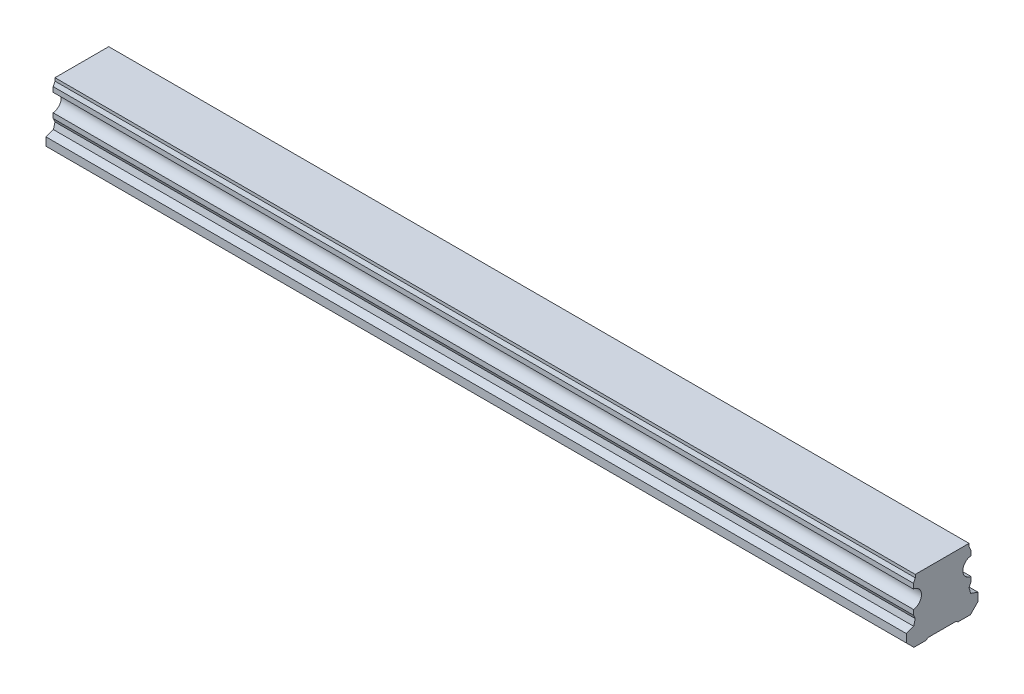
ISO-10303-21;
HEADER;
FILE_DESCRIPTION(('STEP AP214'),'2;1');
FILE_NAME('part.step','',(''),(''),'','','');
FILE_SCHEMA(('AUTOMOTIVE_DESIGN { 1 0 10303 214 1 1 1 1 }'));
ENDSEC;
DATA;
#1=APPLICATION_CONTEXT('core data for automotive mechanical design processes');
#2=APPLICATION_PROTOCOL_DEFINITION('international standard','automotive_design',2000,#1);
#3=PRODUCT_CONTEXT('',#1,'mechanical');
#4=PRODUCT('Part','Part','',(#3));
#5=PRODUCT_RELATED_PRODUCT_CATEGORY('part','',(#4));
#6=PRODUCT_DEFINITION_FORMATION('','',#4);
#7=PRODUCT_DEFINITION_CONTEXT('part definition',#1,'design');
#8=PRODUCT_DEFINITION('design','',#6,#7);
#9=PRODUCT_DEFINITION_SHAPE('','',#8);
#10=(LENGTH_UNIT() NAMED_UNIT(*) SI_UNIT(.MILLI.,.METRE.));
#11=(NAMED_UNIT(*) PLANE_ANGLE_UNIT() SI_UNIT($,.RADIAN.));
#12=(NAMED_UNIT(*) SI_UNIT($,.STERADIAN.) SOLID_ANGLE_UNIT());
#13=UNCERTAINTY_MEASURE_WITH_UNIT(LENGTH_MEASURE(1.E-05),#10,'distance_accuracy_value','');
#14=(GEOMETRIC_REPRESENTATION_CONTEXT(3) GLOBAL_UNCERTAINTY_ASSIGNED_CONTEXT((#13)) GLOBAL_UNIT_ASSIGNED_CONTEXT((#10,
#11,#12)) REPRESENTATION_CONTEXT('',''));
#15=CARTESIAN_POINT('',(0.,0.,0.));
#16=DIRECTION('',(0.,0.,1.));
#17=DIRECTION('',(1.,0.,0.));
#18=AXIS2_PLACEMENT_3D('',#15,#16,#17);
#19=CARTESIAN_POINT('',(270.,0.499999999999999,0.));
#20=DIRECTION('',(0.,-1.,0.));
#21=DIRECTION('',(0.,0.,-1.));
#22=AXIS2_PLACEMENT_3D('',#19,#20,#21);
#23=CONICAL_SURFACE('',#22,3.5,0.785398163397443);
#24=CARTESIAN_POINT('',(270.,1.00000000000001,0.));
#25=DIRECTION('',(0.,1.,0.));
#26=DIRECTION('',(0.,0.,1.));
#27=AXIS2_PLACEMENT_3D('',#24,#25,#26);
#28=CIRCLE('',#27,3.);
#29=CARTESIAN_POINT('',(270.,1.00000000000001,3.));
#30=VERTEX_POINT('',#29);
#31=EDGE_CURVE('E11',#30,#30,#28,.F.);
#32=ORIENTED_EDGE('',*,*,#31,.F.);
#33=EDGE_LOOP('',(#32));
#34=FACE_BOUND('',#33,.T.);
#35=CARTESIAN_POINT('',(270.,0.499999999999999,0.));
#36=DIRECTION('',(0.,1.,0.));
#37=DIRECTION('',(0.,0.,1.));
#38=AXIS2_PLACEMENT_3D('',#35,#36,#37);
#39=CIRCLE('',#38,3.5);
#40=CARTESIAN_POINT('',(270.,0.5,3.5));
#41=VERTEX_POINT('',#40);
#42=EDGE_CURVE('E457',#41,#41,#39,.T.);
#43=ORIENTED_EDGE('',*,*,#42,.F.);
#44=EDGE_LOOP('',(#43));
#45=FACE_BOUND('',#44,.T.);
#46=ADVANCED_FACE('F39',(#34,#45),#23,.F.);
#47=CARTESIAN_POINT('',(270.,12.,0.));
#48=DIRECTION('',(0.,-1.,0.));
#49=DIRECTION('',(0.,0.,-1.));
#50=AXIS2_PLACEMENT_3D('',#47,#48,#49);
#51=CYLINDRICAL_SURFACE('',#50,3.);
#52=ORIENTED_EDGE('',*,*,#31,.T.);
#53=EDGE_LOOP('',(#52));
#54=FACE_BOUND('',#53,.T.);
#55=CARTESIAN_POINT('',(270.,12.,0.));
#56=DIRECTION('',(0.,-1.,0.));
#57=DIRECTION('',(0.,0.,-1.));
#58=AXIS2_PLACEMENT_3D('',#55,#56,#57);
#59=CIRCLE('',#58,3.);
#60=CARTESIAN_POINT('',(270.,12.,-3.));
#61=VERTEX_POINT('',#60);
#62=EDGE_CURVE('E49',#61,#61,#59,.T.);
#63=ORIENTED_EDGE('',*,*,#62,.F.);
#64=EDGE_LOOP('',(#63));
#65=FACE_BOUND('',#64,.T.);
#66=ADVANCED_FACE('F612',(#54,#65),#51,.F.);
#67=CARTESIAN_POINT('',(270.,12.,0.));
#68=DIRECTION('',(0.,-1.,0.));
#69=DIRECTION('',(0.,0.,-1.));
#70=AXIS2_PLACEMENT_3D('',#67,#68,#69);
#71=PLANE('',#70);
#72=CARTESIAN_POINT('',(270.,12.,0.));
#73=DIRECTION('',(0.,-1.,0.));
#74=DIRECTION('',(0.,0.,-1.));
#75=AXIS2_PLACEMENT_3D('',#72,#73,#74);
#76=CIRCLE('',#75,2.5);
#77=CARTESIAN_POINT('',(270.,12.,-2.5));
#78=VERTEX_POINT('',#77);
#79=EDGE_CURVE('E42',#78,#78,#76,.T.);
#80=ORIENTED_EDGE('',*,*,#79,.F.);
#81=EDGE_LOOP('',(#80));
#82=FACE_BOUND('',#81,.T.);
#83=ORIENTED_EDGE('',*,*,#62,.T.);
#84=EDGE_LOOP('',(#83));
#85=FACE_BOUND('',#84,.T.);
#86=ADVANCED_FACE('F617',(#82,#85),#71,.T.);
#87=CARTESIAN_POINT('',(210.,0.499999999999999,0.));
#88=DIRECTION('',(0.,-1.,0.));
#89=DIRECTION('',(0.,0.,-1.));
#90=AXIS2_PLACEMENT_3D('',#87,#88,#89);
#91=CONICAL_SURFACE('',#90,3.5,0.785398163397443);
#92=CARTESIAN_POINT('',(210.,1.00000000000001,0.));
#93=DIRECTION('',(0.,1.,0.));
#94=DIRECTION('',(0.,0.,1.));
#95=AXIS2_PLACEMENT_3D('',#92,#93,#94);
#96=CIRCLE('',#95,3.);
#97=CARTESIAN_POINT('',(210.,1.00000000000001,3.));
#98=VERTEX_POINT('',#97);
#99=EDGE_CURVE('E453',#98,#98,#96,.F.);
#100=ORIENTED_EDGE('',*,*,#99,.F.);
#101=EDGE_LOOP('',(#100));
#102=FACE_BOUND('',#101,.T.);
#103=CARTESIAN_POINT('',(210.,0.499999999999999,0.));
#104=DIRECTION('',(0.,1.,0.));
#105=DIRECTION('',(0.,0.,1.));
#106=AXIS2_PLACEMENT_3D('',#103,#104,#105);
#107=CIRCLE('',#106,3.5);
#108=CARTESIAN_POINT('',(210.,0.5,3.5));
#109=VERTEX_POINT('',#108);
#110=EDGE_CURVE('E445',#109,#109,#107,.T.);
#111=ORIENTED_EDGE('',*,*,#110,.F.);
#112=EDGE_LOOP('',(#111));
#113=FACE_BOUND('',#112,.T.);
#114=ADVANCED_FACE('F716',(#102,#113),#91,.F.);
#115=CARTESIAN_POINT('',(210.,12.,0.));
#116=DIRECTION('',(0.,-1.,0.));
#117=DIRECTION('',(0.,0.,-1.));
#118=AXIS2_PLACEMENT_3D('',#115,#116,#117);
#119=CYLINDRICAL_SURFACE('',#118,3.);
#120=ORIENTED_EDGE('',*,*,#99,.T.);
#121=EDGE_LOOP('',(#120));
#122=FACE_BOUND('',#121,.T.);
#123=CARTESIAN_POINT('',(210.,12.,0.));
#124=DIRECTION('',(0.,-1.,0.));
#125=DIRECTION('',(0.,0.,-1.));
#126=AXIS2_PLACEMENT_3D('',#123,#124,#125);
#127=CIRCLE('',#126,3.);
#128=CARTESIAN_POINT('',(210.,12.,-3.));
#129=VERTEX_POINT('',#128);
#130=EDGE_CURVE('E449',#129,#129,#127,.T.);
#131=ORIENTED_EDGE('',*,*,#130,.F.);
#132=EDGE_LOOP('',(#131));
#133=FACE_BOUND('',#132,.T.);
#134=ADVANCED_FACE('F712',(#122,#133),#119,.F.);
#135=CARTESIAN_POINT('',(210.,12.,0.));
#136=DIRECTION('',(0.,-1.,0.));
#137=DIRECTION('',(0.,0.,-1.));
#138=AXIS2_PLACEMENT_3D('',#135,#136,#137);
#139=PLANE('',#138);
#140=CARTESIAN_POINT('',(210.,12.,0.));
#141=DIRECTION('',(0.,-1.,0.));
#142=DIRECTION('',(0.,0.,-1.));
#143=AXIS2_PLACEMENT_3D('',#140,#141,#142);
#144=CIRCLE('',#143,2.5);
#145=CARTESIAN_POINT('',(210.,12.,-2.5));
#146=VERTEX_POINT('',#145);
#147=EDGE_CURVE('E472',#146,#146,#144,.T.);
#148=ORIENTED_EDGE('',*,*,#147,.F.);
#149=EDGE_LOOP('',(#148));
#150=FACE_BOUND('',#149,.T.);
#151=ORIENTED_EDGE('',*,*,#130,.T.);
#152=EDGE_LOOP('',(#151));
#153=FACE_BOUND('',#152,.T.);
#154=ADVANCED_FACE('F708',(#150,#153),#139,.T.);
#155=CARTESIAN_POINT('',(150.,0.499999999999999,0.));
#156=DIRECTION('',(0.,-1.,0.));
#157=DIRECTION('',(0.,0.,-1.));
#158=AXIS2_PLACEMENT_3D('',#155,#156,#157);
#159=CONICAL_SURFACE('',#158,3.5,0.785398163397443);
#160=CARTESIAN_POINT('',(150.,1.00000000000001,0.));
#161=DIRECTION('',(0.,1.,0.));
#162=DIRECTION('',(0.,0.,1.));
#163=AXIS2_PLACEMENT_3D('',#160,#161,#162);
#164=CIRCLE('',#163,3.);
#165=CARTESIAN_POINT('',(150.,1.00000000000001,3.));
#166=VERTEX_POINT('',#165);
#167=EDGE_CURVE('E441',#166,#166,#164,.F.);
#168=ORIENTED_EDGE('',*,*,#167,.F.);
#169=EDGE_LOOP('',(#168));
#170=FACE_BOUND('',#169,.T.);
#171=CARTESIAN_POINT('',(150.,0.499999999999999,0.));
#172=DIRECTION('',(0.,1.,0.));
#173=DIRECTION('',(0.,0.,1.));
#174=AXIS2_PLACEMENT_3D('',#171,#172,#173);
#175=CIRCLE('',#174,3.5);
#176=CARTESIAN_POINT('',(150.,0.5,3.5));
#177=VERTEX_POINT('',#176);
#178=EDGE_CURVE('E433',#177,#177,#175,.T.);
#179=ORIENTED_EDGE('',*,*,#178,.F.);
#180=EDGE_LOOP('',(#179));
#181=FACE_BOUND('',#180,.T.);
#182=ADVANCED_FACE('F704',(#170,#181),#159,.F.);
#183=CARTESIAN_POINT('',(150.,12.,0.));
#184=DIRECTION('',(0.,-1.,0.));
#185=DIRECTION('',(0.,0.,-1.));
#186=AXIS2_PLACEMENT_3D('',#183,#184,#185);
#187=CYLINDRICAL_SURFACE('',#186,3.);
#188=ORIENTED_EDGE('',*,*,#167,.T.);
#189=EDGE_LOOP('',(#188));
#190=FACE_BOUND('',#189,.T.);
#191=CARTESIAN_POINT('',(150.,12.,0.));
#192=DIRECTION('',(0.,-1.,0.));
#193=DIRECTION('',(0.,0.,-1.));
#194=AXIS2_PLACEMENT_3D('',#191,#192,#193);
#195=CIRCLE('',#194,3.);
#196=CARTESIAN_POINT('',(150.,12.,-3.));
#197=VERTEX_POINT('',#196);
#198=EDGE_CURVE('E437',#197,#197,#195,.T.);
#199=ORIENTED_EDGE('',*,*,#198,.F.);
#200=EDGE_LOOP('',(#199));
#201=FACE_BOUND('',#200,.T.);
#202=ADVANCED_FACE('F700',(#190,#201),#187,.F.);
#203=CARTESIAN_POINT('',(150.,12.,0.));
#204=DIRECTION('',(0.,-1.,0.));
#205=DIRECTION('',(0.,0.,-1.));
#206=AXIS2_PLACEMENT_3D('',#203,#204,#205);
#207=PLANE('',#206);
#208=CARTESIAN_POINT('',(150.,12.,0.));
#209=DIRECTION('',(0.,-1.,0.));
#210=DIRECTION('',(0.,0.,-1.));
#211=AXIS2_PLACEMENT_3D('',#208,#209,#210);
#212=CIRCLE('',#211,2.5);
#213=CARTESIAN_POINT('',(150.,12.,-2.5));
#214=VERTEX_POINT('',#213);
#215=EDGE_CURVE('E468',#214,#214,#212,.T.);
#216=ORIENTED_EDGE('',*,*,#215,.F.);
#217=EDGE_LOOP('',(#216));
#218=FACE_BOUND('',#217,.T.);
#219=ORIENTED_EDGE('',*,*,#198,.T.);
#220=EDGE_LOOP('',(#219));
#221=FACE_BOUND('',#220,.T.);
#222=ADVANCED_FACE('F690',(#218,#221),#207,.T.);
#223=CARTESIAN_POINT('',(300.,21.8,-9.375));
#224=DIRECTION('',(0.,0.,1.));
#225=DIRECTION('',(0.,-1.,0.));
#226=AXIS2_PLACEMENT_3D('',#223,#224,#225);
#227=PLANE('',#226);
#228=DIRECTION('',(0.,1.,0.));
#229=VECTOR('',#228,1.);
#230=CARTESIAN_POINT('',(0.,21.8,-9.375));
#231=LINE('',#230,#229);
#232=CARTESIAN_POINT('',(0.,20.756,-9.375));
#233=VERTEX_POINT('',#232);
#234=CARTESIAN_POINT('',(0.,21.8,-9.375));
#235=VERTEX_POINT('',#234);
#236=EDGE_CURVE('E256',#233,#235,#231,.T.);
#237=ORIENTED_EDGE('',*,*,#236,.T.);
#238=DIRECTION('',(-1.,0.,0.));
#239=VECTOR('',#238,1.);
#240=CARTESIAN_POINT('',(300.,21.8,-9.375));
#241=LINE('',#240,#239);
#242=CARTESIAN_POINT('',(300.,21.8,-9.375));
#243=VERTEX_POINT('',#242);
#244=EDGE_CURVE('E422',#243,#235,#241,.T.);
#245=ORIENTED_EDGE('',*,*,#244,.F.);
#246=DIRECTION('',(0.,1.,0.));
#247=VECTOR('',#246,1.);
#248=CARTESIAN_POINT('',(300.,21.8,-9.375));
#249=LINE('',#248,#247);
#250=CARTESIAN_POINT('',(300.,20.756,-9.375));
#251=VERTEX_POINT('',#250);
#252=EDGE_CURVE('E331',#251,#243,#249,.T.);
#253=ORIENTED_EDGE('',*,*,#252,.F.);
#254=DIRECTION('',(-1.,0.,0.));
#255=VECTOR('',#254,1.);
#256=CARTESIAN_POINT('',(300.,20.756,-9.375));
#257=LINE('',#256,#255);
#258=EDGE_CURVE('E252',#251,#233,#257,.T.);
#259=ORIENTED_EDGE('',*,*,#258,.T.);
#260=EDGE_LOOP('',(#237,#245,#253,#259));
#261=FACE_BOUND('',#260,.T.);
#262=ADVANCED_FACE('F687',(#261),#227,.F.);
#263=CARTESIAN_POINT('',(300.,21.8,-9.375));
#264=DIRECTION('',(0.,-1.,0.));
#265=DIRECTION('',(0.,0.,-1.));
#266=AXIS2_PLACEMENT_3D('',#263,#264,#265);
#267=PLANE('',#266);
#268=DIRECTION('',(0.,0.,1.));
#269=VECTOR('',#268,1.);
#270=CARTESIAN_POINT('',(0.,21.8,-9.375));
#271=LINE('',#270,#269);
#272=CARTESIAN_POINT('',(0.,21.8,9.375));
#273=VERTEX_POINT('',#272);
#274=EDGE_CURVE('E260',#235,#273,#271,.T.);
#275=ORIENTED_EDGE('',*,*,#274,.T.);
#276=DIRECTION('',(-1.,0.,0.));
#277=VECTOR('',#276,1.);
#278=CARTESIAN_POINT('',(300.,21.8,9.375));
#279=LINE('',#278,#277);
#280=CARTESIAN_POINT('',(300.,21.8,9.375));
#281=VERTEX_POINT('',#280);
#282=EDGE_CURVE('E418',#281,#273,#279,.T.);
#283=ORIENTED_EDGE('',*,*,#282,.F.);
#284=DIRECTION('',(0.,0.,1.));
#285=VECTOR('',#284,1.);
#286=CARTESIAN_POINT('',(300.,21.8,-9.375));
#287=LINE('',#286,#285);
#288=EDGE_CURVE('E157',#243,#281,#287,.T.);
#289=ORIENTED_EDGE('',*,*,#288,.F.);
#290=ORIENTED_EDGE('',*,*,#244,.T.);
#291=EDGE_LOOP('',(#275,#283,#289,#290));
#292=FACE_BOUND('',#291,.T.);
#293=ADVANCED_FACE('F683',(#292),#267,.F.);
#294=CARTESIAN_POINT('',(300.,21.8,9.375));
#295=DIRECTION('',(0.,0.,-1.));
#296=DIRECTION('',(0.,1.,0.));
#297=AXIS2_PLACEMENT_3D('',#294,#295,#296);
#298=PLANE('',#297);
#299=DIRECTION('',(0.,-1.,0.));
#300=VECTOR('',#299,1.);
#301=CARTESIAN_POINT('',(0.,21.8,9.375));
#302=LINE('',#301,#300);
#303=CARTESIAN_POINT('',(0.,20.756,9.37499999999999));
#304=VERTEX_POINT('',#303);
#305=EDGE_CURVE('E264',#273,#304,#302,.T.);
#306=ORIENTED_EDGE('',*,*,#305,.T.);
#307=DIRECTION('',(-1.,0.,0.));
#308=VECTOR('',#307,1.);
#309=CARTESIAN_POINT('',(300.,20.756,9.37499999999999));
#310=LINE('',#309,#308);
#311=CARTESIAN_POINT('',(300.,20.756,9.37499999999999));
#312=VERTEX_POINT('',#311);
#313=EDGE_CURVE('E414',#312,#304,#310,.T.);
#314=ORIENTED_EDGE('',*,*,#313,.F.);
#315=DIRECTION('',(0.,-1.,0.));
#316=VECTOR('',#315,1.);
#317=CARTESIAN_POINT('',(300.,21.8,9.375));
#318=LINE('',#317,#316);
#319=EDGE_CURVE('E515',#281,#312,#318,.T.);
#320=ORIENTED_EDGE('',*,*,#319,.F.);
#321=ORIENTED_EDGE('',*,*,#282,.T.);
#322=EDGE_LOOP('',(#306,#314,#320,#321));
#323=FACE_BOUND('',#322,.T.);
#324=ADVANCED_FACE('F679',(#323),#298,.F.);
#325=CARTESIAN_POINT('',(300.,20.756,9.37499999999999));
#326=DIRECTION('',(0.,-0.422618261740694,-0.906307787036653));
#327=DIRECTION('',(0.,0.906307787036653,-0.422618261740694));
#328=AXIS2_PLACEMENT_3D('',#325,#326,#327);
#329=PLANE('',#328);
#330=DIRECTION('',(0.,-0.906307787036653,0.422618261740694));
#331=VECTOR('',#330,1.);
#332=CARTESIAN_POINT('',(0.,20.756,9.37499999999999));
#333=LINE('',#332,#331);
#334=CARTESIAN_POINT('',(0.,19.4156831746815,10.));
#335=VERTEX_POINT('',#334);
#336=EDGE_CURVE('E267',#304,#335,#333,.T.);
#337=ORIENTED_EDGE('',*,*,#336,.T.);
#338=DIRECTION('',(-1.,0.,0.));
#339=VECTOR('',#338,1.);
#340=CARTESIAN_POINT('',(300.,19.4156831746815,10.));
#341=LINE('',#340,#339);
#342=CARTESIAN_POINT('',(300.,19.4156831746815,10.));
#343=VERTEX_POINT('',#342);
#344=EDGE_CURVE('E410',#343,#335,#341,.T.);
#345=ORIENTED_EDGE('',*,*,#344,.F.);
#346=DIRECTION('',(0.,-0.906307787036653,0.422618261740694));
#347=VECTOR('',#346,1.);
#348=CARTESIAN_POINT('',(300.,20.756,9.37499999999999));
#349=LINE('',#348,#347);
#350=EDGE_CURVE('E518',#312,#343,#349,.T.);
#351=ORIENTED_EDGE('',*,*,#350,.F.);
#352=ORIENTED_EDGE('',*,*,#313,.T.);
#353=EDGE_LOOP('',(#337,#345,#351,#352));
#354=FACE_BOUND('',#353,.T.);
#355=ADVANCED_FACE('F675',(#354),#329,.F.);
#356=CARTESIAN_POINT('',(300.,19.4156831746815,10.));
#357=DIRECTION('',(0.,0.,-1.));
#358=DIRECTION('',(-1.,0.,0.));
#359=AXIS2_PLACEMENT_3D('',#356,#357,#358);
#360=PLANE('',#359);
#361=DIRECTION('',(0.,-1.,0.));
#362=VECTOR('',#361,1.);
#363=CARTESIAN_POINT('',(0.,19.4156831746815,10.));
#364=LINE('',#363,#362);
#365=CARTESIAN_POINT('',(0.,17.6854497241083,10.));
#366=VERTEX_POINT('',#365);
#367=EDGE_CURVE('E269',#335,#366,#364,.T.);
#368=ORIENTED_EDGE('',*,*,#367,.T.);
#369=DIRECTION('',(-1.,0.,0.));
#370=VECTOR('',#369,1.);
#371=CARTESIAN_POINT('',(300.,17.6854497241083,10.));
#372=LINE('',#371,#370);
#373=CARTESIAN_POINT('',(300.,17.6854497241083,10.));
#374=VERTEX_POINT('',#373);
#375=EDGE_CURVE('E406',#374,#366,#372,.T.);
#376=ORIENTED_EDGE('',*,*,#375,.F.);
#377=DIRECTION('',(0.,-1.,0.));
#378=VECTOR('',#377,1.);
#379=CARTESIAN_POINT('',(300.,19.4156831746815,10.));
#380=LINE('',#379,#378);
#381=EDGE_CURVE('E521',#343,#374,#380,.T.);
#382=ORIENTED_EDGE('',*,*,#381,.F.);
#383=ORIENTED_EDGE('',*,*,#344,.T.);
#384=EDGE_LOOP('',(#368,#376,#382,#383));
#385=FACE_BOUND('',#384,.T.);
#386=ADVANCED_FACE('F671',(#385),#360,.F.);
#387=CARTESIAN_POINT('',(300.,14.6,10.3));
#388=DIRECTION('',(-1.,0.,0.));
#389=DIRECTION('',(0.,0.,1.));
#390=AXIS2_PLACEMENT_3D('',#387,#388,#389);
#391=CYLINDRICAL_SURFACE('',#390,3.1);
#392=CARTESIAN_POINT('',(0.,14.6,10.3));
#393=DIRECTION('',(-1.,0.,0.));
#394=DIRECTION('',(0.,0.,-1.));
#395=AXIS2_PLACEMENT_3D('',#392,#393,#394);
#396=CIRCLE('',#395,3.1);
#397=CARTESIAN_POINT('',(0.,11.5145502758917,10.));
#398=VERTEX_POINT('',#397);
#399=EDGE_CURVE('E272',#366,#398,#396,.T.);
#400=ORIENTED_EDGE('',*,*,#399,.T.);
#401=DIRECTION('',(-1.,0.,0.));
#402=VECTOR('',#401,1.);
#403=CARTESIAN_POINT('',(300.,11.5145502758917,10.));
#404=LINE('',#403,#402);
#405=CARTESIAN_POINT('',(300.,11.5145502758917,10.));
#406=VERTEX_POINT('',#405);
#407=EDGE_CURVE('E402',#406,#398,#404,.T.);
#408=ORIENTED_EDGE('',*,*,#407,.F.);
#409=CARTESIAN_POINT('',(300.,14.6,10.3));
#410=DIRECTION('',(-1.,0.,0.));
#411=DIRECTION('',(0.,0.,-1.));
#412=AXIS2_PLACEMENT_3D('',#409,#410,#411);
#413=CIRCLE('',#412,3.1);
#414=EDGE_CURVE('E524',#374,#406,#413,.T.);
#415=ORIENTED_EDGE('',*,*,#414,.F.);
#416=ORIENTED_EDGE('',*,*,#375,.T.);
#417=EDGE_LOOP('',(#400,#408,#415,#416));
#418=FACE_BOUND('',#417,.T.);
#419=ADVANCED_FACE('F667',(#418),#391,.F.);
#420=CARTESIAN_POINT('',(300.,9.78431682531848,10.));
#421=DIRECTION('',(0.,0.,-1.));
#422=DIRECTION('',(0.,1.,0.));
#423=AXIS2_PLACEMENT_3D('',#420,#421,#422);
#424=PLANE('',#423);
#425=DIRECTION('',(0.,-1.,0.));
#426=VECTOR('',#425,1.);
#427=CARTESIAN_POINT('',(0.,9.78431682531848,10.));
#428=LINE('',#427,#426);
#429=CARTESIAN_POINT('',(0.,9.78431682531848,10.));
#430=VERTEX_POINT('',#429);
#431=EDGE_CURVE('E275',#398,#430,#428,.T.);
#432=ORIENTED_EDGE('',*,*,#431,.T.);
#433=DIRECTION('',(-1.,0.,0.));
#434=VECTOR('',#433,1.);
#435=CARTESIAN_POINT('',(300.,9.78431682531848,10.));
#436=LINE('',#435,#434);
#437=CARTESIAN_POINT('',(300.,9.78431682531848,10.));
#438=VERTEX_POINT('',#437);
#439=EDGE_CURVE('E398',#438,#430,#436,.T.);
#440=ORIENTED_EDGE('',*,*,#439,.F.);
#441=DIRECTION('',(0.,-1.,0.));
#442=VECTOR('',#441,1.);
#443=CARTESIAN_POINT('',(300.,9.78431682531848,10.));
#444=LINE('',#443,#442);
#445=EDGE_CURVE('E526',#406,#438,#444,.T.);
#446=ORIENTED_EDGE('',*,*,#445,.F.);
#447=ORIENTED_EDGE('',*,*,#407,.T.);
#448=EDGE_LOOP('',(#432,#440,#446,#447));
#449=FACE_BOUND('',#448,.T.);
#450=ADVANCED_FACE('F663',(#449),#424,.F.);
#451=CARTESIAN_POINT('',(300.,8.44400000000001,9.375));
#452=DIRECTION('',(0.,0.4226182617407,-0.90630778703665));
#453=DIRECTION('',(0.,0.90630778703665,0.4226182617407));
#454=AXIS2_PLACEMENT_3D('',#451,#452,#453);
#455=PLANE('',#454);
#456=DIRECTION('',(0.,-0.90630778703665,-0.4226182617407));
#457=VECTOR('',#456,1.);
#458=CARTESIAN_POINT('',(0.,8.44400000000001,9.375));
#459=LINE('',#458,#457);
#460=CARTESIAN_POINT('',(0.,8.44400000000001,9.375));
#461=VERTEX_POINT('',#460);
#462=EDGE_CURVE('E278',#430,#461,#459,.T.);
#463=ORIENTED_EDGE('',*,*,#462,.T.);
#464=DIRECTION('',(-1.,0.,0.));
#465=VECTOR('',#464,1.);
#466=CARTESIAN_POINT('',(300.,8.44400000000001,9.375));
#467=LINE('',#466,#465);
#468=CARTESIAN_POINT('',(300.,8.44400000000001,9.375));
#469=VERTEX_POINT('',#468);
#470=EDGE_CURVE('E394',#469,#461,#467,.T.);
#471=ORIENTED_EDGE('',*,*,#470,.F.);
#472=DIRECTION('',(0.,-0.90630778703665,-0.4226182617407));
#473=VECTOR('',#472,1.);
#474=CARTESIAN_POINT('',(300.,8.44400000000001,9.375));
#475=LINE('',#474,#473);
#476=EDGE_CURVE('E529',#438,#469,#475,.T.);
#477=ORIENTED_EDGE('',*,*,#476,.F.);
#478=ORIENTED_EDGE('',*,*,#439,.T.);
#479=EDGE_LOOP('',(#463,#471,#477,#478));
#480=FACE_BOUND('',#479,.T.);
#481=ADVANCED_FACE('F659',(#480),#455,.F.);
#482=CARTESIAN_POINT('',(300.,6.4,9.92268814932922));
#483=DIRECTION('',(0.,-0.258819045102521,-0.965925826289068));
#484=DIRECTION('',(0.,0.965925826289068,-0.258819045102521));
#485=AXIS2_PLACEMENT_3D('',#482,#483,#484);
#486=PLANE('',#485);
#487=DIRECTION('',(0.,-0.965925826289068,0.258819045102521));
#488=VECTOR('',#487,1.);
#489=CARTESIAN_POINT('',(0.,6.4,9.92268814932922));
#490=LINE('',#489,#488);
#491=CARTESIAN_POINT('',(0.,6.4,9.92268814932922));
#492=VERTEX_POINT('',#491);
#493=EDGE_CURVE('E281',#461,#492,#490,.T.);
#494=ORIENTED_EDGE('',*,*,#493,.T.);
#495=DIRECTION('',(-1.,0.,0.));
#496=VECTOR('',#495,1.);
#497=CARTESIAN_POINT('',(300.,6.4,9.92268814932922));
#498=LINE('',#497,#496);
#499=CARTESIAN_POINT('',(300.,6.4,9.92268814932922));
#500=VERTEX_POINT('',#499);
#501=EDGE_CURVE('E390',#500,#492,#498,.T.);
#502=ORIENTED_EDGE('',*,*,#501,.F.);
#503=DIRECTION('',(0.,-0.965925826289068,0.258819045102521));
#504=VECTOR('',#503,1.);
#505=CARTESIAN_POINT('',(300.,6.4,9.92268814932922));
#506=LINE('',#505,#504);
#507=EDGE_CURVE('E532',#469,#500,#506,.T.);
#508=ORIENTED_EDGE('',*,*,#507,.F.);
#509=ORIENTED_EDGE('',*,*,#470,.T.);
#510=EDGE_LOOP('',(#494,#502,#508,#509));
#511=FACE_BOUND('',#510,.T.);
#512=ADVANCED_FACE('F655',(#511),#486,.F.);
#513=CARTESIAN_POINT('',(300.,5.48933857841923,12.5));
#514=DIRECTION('',(0.,-0.942872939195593,-0.333152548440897));
#515=DIRECTION('',(0.,0.333152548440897,-0.942872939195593));
#516=AXIS2_PLACEMENT_3D('',#513,#514,#515);
#517=PLANE('',#516);
#518=DIRECTION('',(0.,-0.333152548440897,0.942872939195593));
#519=VECTOR('',#518,1.);
#520=CARTESIAN_POINT('',(0.,5.48933857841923,12.5));
#521=LINE('',#520,#519);
#522=CARTESIAN_POINT('',(0.,5.48933857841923,12.5));
#523=VERTEX_POINT('',#522);
#524=EDGE_CURVE('E284',#492,#523,#521,.T.);
#525=ORIENTED_EDGE('',*,*,#524,.T.);
#526=DIRECTION('',(-1.,0.,0.));
#527=VECTOR('',#526,1.);
#528=CARTESIAN_POINT('',(300.,5.48933857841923,12.5));
#529=LINE('',#528,#527);
#530=CARTESIAN_POINT('',(300.,5.48933857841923,12.5));
#531=VERTEX_POINT('',#530);
#532=EDGE_CURVE('E386',#531,#523,#529,.T.);
#533=ORIENTED_EDGE('',*,*,#532,.F.);
#534=DIRECTION('',(0.,-0.333152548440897,0.942872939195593));
#535=VECTOR('',#534,1.);
#536=CARTESIAN_POINT('',(300.,5.48933857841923,12.5));
#537=LINE('',#536,#535);
#538=EDGE_CURVE('E535',#500,#531,#537,.T.);
#539=ORIENTED_EDGE('',*,*,#538,.F.);
#540=ORIENTED_EDGE('',*,*,#501,.T.);
#541=EDGE_LOOP('',(#525,#533,#539,#540));
#542=FACE_BOUND('',#541,.T.);
#543=ADVANCED_FACE('F651',(#542),#517,.F.);
#544=CARTESIAN_POINT('',(300.,2.65,12.5));
#545=DIRECTION('',(0.,0.,-1.));
#546=DIRECTION('',(0.,1.,0.));
#547=AXIS2_PLACEMENT_3D('',#544,#545,#546);
#548=PLANE('',#547);
#549=DIRECTION('',(0.,-1.,0.));
#550=VECTOR('',#549,1.);
#551=CARTESIAN_POINT('',(0.,2.65,12.5));
#552=LINE('',#551,#550);
#553=CARTESIAN_POINT('',(0.,2.65,12.5));
#554=VERTEX_POINT('',#553);
#555=EDGE_CURVE('E287',#523,#554,#552,.T.);
#556=ORIENTED_EDGE('',*,*,#555,.T.);
#557=DIRECTION('',(-1.,0.,0.));
#558=VECTOR('',#557,1.);
#559=CARTESIAN_POINT('',(300.,2.65,12.5));
#560=LINE('',#559,#558);
#561=CARTESIAN_POINT('',(300.,2.65,12.5));
#562=VERTEX_POINT('',#561);
#563=EDGE_CURVE('E382',#562,#554,#560,.T.);
#564=ORIENTED_EDGE('',*,*,#563,.F.);
#565=DIRECTION('',(0.,-1.,0.));
#566=VECTOR('',#565,1.);
#567=CARTESIAN_POINT('',(300.,2.65,12.5));
#568=LINE('',#567,#566);
#569=EDGE_CURVE('E538',#531,#562,#568,.T.);
#570=ORIENTED_EDGE('',*,*,#569,.F.);
#571=ORIENTED_EDGE('',*,*,#532,.T.);
#572=EDGE_LOOP('',(#556,#564,#570,#571));
#573=FACE_BOUND('',#572,.T.);
#574=ADVANCED_FACE('F647',(#573),#548,.F.);
#575=CARTESIAN_POINT('',(300.,0.,9.85));
#576=DIRECTION('',(0.,0.707106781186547,-0.707106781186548));
#577=DIRECTION('',(0.,0.707106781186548,0.707106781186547));
#578=AXIS2_PLACEMENT_3D('',#575,#576,#577);
#579=PLANE('',#578);
#580=DIRECTION('',(0.,-0.707106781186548,-0.707106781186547));
#581=VECTOR('',#580,1.);
#582=CARTESIAN_POINT('',(0.,0.,9.85));
#583=LINE('',#582,#581);
#584=CARTESIAN_POINT('',(0.,0.,9.85));
#585=VERTEX_POINT('',#584);
#586=EDGE_CURVE('E290',#554,#585,#583,.T.);
#587=ORIENTED_EDGE('',*,*,#586,.T.);
#588=DIRECTION('',(-1.,0.,0.));
#589=VECTOR('',#588,1.);
#590=CARTESIAN_POINT('',(300.,0.,9.85));
#591=LINE('',#590,#589);
#592=CARTESIAN_POINT('',(300.,0.,9.85));
#593=VERTEX_POINT('',#592);
#594=EDGE_CURVE('E378',#593,#585,#591,.T.);
#595=ORIENTED_EDGE('',*,*,#594,.F.);
#596=DIRECTION('',(0.,-0.707106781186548,-0.707106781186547));
#597=VECTOR('',#596,1.);
#598=CARTESIAN_POINT('',(300.,0.,9.85));
#599=LINE('',#598,#597);
#600=EDGE_CURVE('E541',#562,#593,#599,.T.);
#601=ORIENTED_EDGE('',*,*,#600,.F.);
#602=ORIENTED_EDGE('',*,*,#563,.T.);
#603=EDGE_LOOP('',(#587,#595,#601,#602));
#604=FACE_BOUND('',#603,.T.);
#605=ADVANCED_FACE('F643',(#604),#579,.F.);
#606=CARTESIAN_POINT('',(300.,0.,5.5));
#607=DIRECTION('',(0.,1.,0.));
#608=DIRECTION('',(0.,0.,1.));
#609=AXIS2_PLACEMENT_3D('',#606,#607,#608);
#610=PLANE('',#609);
#611=DIRECTION('',(0.,0.,-1.));
#612=VECTOR('',#611,1.);
#613=CARTESIAN_POINT('',(0.,0.,5.5));
#614=LINE('',#613,#612);
#615=CARTESIAN_POINT('',(0.,0.,5.5));
#616=VERTEX_POINT('',#615);
#617=EDGE_CURVE('E293',#585,#616,#614,.T.);
#618=ORIENTED_EDGE('',*,*,#617,.T.);
#619=DIRECTION('',(-1.,0.,0.));
#620=VECTOR('',#619,1.);
#621=CARTESIAN_POINT('',(300.,0.,5.5));
#622=LINE('',#621,#620);
#623=CARTESIAN_POINT('',(300.,0.,5.5));
#624=VERTEX_POINT('',#623);
#625=EDGE_CURVE('E374',#624,#616,#622,.T.);
#626=ORIENTED_EDGE('',*,*,#625,.F.);
#627=DIRECTION('',(0.,0.,-1.));
#628=VECTOR('',#627,1.);
#629=CARTESIAN_POINT('',(300.,0.,5.5));
#630=LINE('',#629,#628);
#631=EDGE_CURVE('E544',#593,#624,#630,.T.);
#632=ORIENTED_EDGE('',*,*,#631,.F.);
#633=ORIENTED_EDGE('',*,*,#594,.T.);
#634=EDGE_LOOP('',(#618,#626,#632,#633));
#635=FACE_BOUND('',#634,.T.);
#636=ADVANCED_FACE('F635',(#635),#610,.F.);
#637=CARTESIAN_POINT('',(300.,0.5,5.));
#638=DIRECTION('',(0.,0.707106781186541,0.707106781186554));
#639=DIRECTION('',(0.,-0.707106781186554,0.707106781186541));
#640=AXIS2_PLACEMENT_3D('',#637,#638,#639);
#641=PLANE('',#640);
#642=DIRECTION('',(0.,0.707106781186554,-0.707106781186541));
#643=VECTOR('',#642,1.);
#644=CARTESIAN_POINT('',(0.,0.5,5.));
#645=LINE('',#644,#643);
#646=CARTESIAN_POINT('',(0.,0.5,5.));
#647=VERTEX_POINT('',#646);
#648=EDGE_CURVE('E296',#616,#647,#645,.T.);
#649=ORIENTED_EDGE('',*,*,#648,.T.);
#650=DIRECTION('',(-1.,0.,0.));
#651=VECTOR('',#650,1.);
#652=CARTESIAN_POINT('',(300.,0.5,5.));
#653=LINE('',#652,#651);
#654=CARTESIAN_POINT('',(300.,0.5,5.));
#655=VERTEX_POINT('',#654);
#656=EDGE_CURVE('E370',#655,#647,#653,.T.);
#657=ORIENTED_EDGE('',*,*,#656,.F.);
#658=DIRECTION('',(0.,0.707106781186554,-0.707106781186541));
#659=VECTOR('',#658,1.);
#660=CARTESIAN_POINT('',(300.,0.5,5.));
#661=LINE('',#660,#659);
#662=EDGE_CURVE('E547',#624,#655,#661,.T.);
#663=ORIENTED_EDGE('',*,*,#662,.F.);
#664=ORIENTED_EDGE('',*,*,#625,.T.);
#665=EDGE_LOOP('',(#649,#657,#663,#664));
#666=FACE_BOUND('',#665,.T.);
#667=ADVANCED_FACE('F626',(#666),#641,.F.);
#668=CARTESIAN_POINT('',(300.,0.499999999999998,-5.));
#669=DIRECTION('',(0.,1.,0.));
#670=DIRECTION('',(0.,0.,1.));
#671=AXIS2_PLACEMENT_3D('',#668,#669,#670);
#672=PLANE('',#671);
#673=CARTESIAN_POINT('',(90.,0.499999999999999,0.));
#674=DIRECTION('',(0.,1.,0.));
#675=DIRECTION('',(0.,0.,1.));
#676=AXIS2_PLACEMENT_3D('',#673,#674,#675);
#677=CIRCLE('',#676,3.5);
#678=CARTESIAN_POINT('',(90.,0.5,3.5));
#679=VERTEX_POINT('',#678);
#680=EDGE_CURVE('E479',#679,#679,#677,.T.);
#681=ORIENTED_EDGE('',*,*,#680,.T.);
#682=EDGE_LOOP('',(#681));
#683=FACE_BOUND('',#682,.T.);
#684=CARTESIAN_POINT('',(30.,0.499999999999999,0.));
#685=DIRECTION('',(0.,1.,0.));
#686=DIRECTION('',(0.,0.,1.));
#687=AXIS2_PLACEMENT_3D('',#684,#685,#686);
#688=CIRCLE('',#687,3.5);
#689=CARTESIAN_POINT('',(30.,0.5,3.5));
#690=VERTEX_POINT('',#689);
#691=EDGE_CURVE('E425',#690,#690,#688,.T.);
#692=ORIENTED_EDGE('',*,*,#691,.T.);
#693=EDGE_LOOP('',(#692));
#694=FACE_BOUND('',#693,.T.);
#695=DIRECTION('',(0.,0.,-1.));
#696=VECTOR('',#695,1.);
#697=CARTESIAN_POINT('',(0.,0.499999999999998,-5.));
#698=LINE('',#697,#696);
#699=CARTESIAN_POINT('',(0.,0.499999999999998,-5.));
#700=VERTEX_POINT('',#699);
#701=EDGE_CURVE('E299',#647,#700,#698,.T.);
#702=ORIENTED_EDGE('',*,*,#701,.T.);
#703=DIRECTION('',(-1.,0.,0.));
#704=VECTOR('',#703,1.);
#705=CARTESIAN_POINT('',(300.,0.499999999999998,-5.));
#706=LINE('',#705,#704);
#707=CARTESIAN_POINT('',(300.,0.499999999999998,-5.));
#708=VERTEX_POINT('',#707);
#709=EDGE_CURVE('E366',#708,#700,#706,.T.);
#710=ORIENTED_EDGE('',*,*,#709,.F.);
#711=DIRECTION('',(0.,0.,-1.));
#712=VECTOR('',#711,1.);
#713=CARTESIAN_POINT('',(300.,0.499999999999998,-5.));
#714=LINE('',#713,#712);
#715=EDGE_CURVE('E550',#655,#708,#714,.T.);
#716=ORIENTED_EDGE('',*,*,#715,.F.);
#717=ORIENTED_EDGE('',*,*,#656,.T.);
#718=EDGE_LOOP('',(#702,#710,#716,#717));
#719=FACE_BOUND('',#718,.T.);
#720=ORIENTED_EDGE('',*,*,#178,.T.);
#721=EDGE_LOOP('',(#720));
#722=FACE_BOUND('',#721,.T.);
#723=ORIENTED_EDGE('',*,*,#110,.T.);
#724=EDGE_LOOP('',(#723));
#725=FACE_BOUND('',#724,.T.);
#726=ORIENTED_EDGE('',*,*,#42,.T.);
#727=EDGE_LOOP('',(#726));
#728=FACE_BOUND('',#727,.T.);
#729=ADVANCED_FACE('F623',(#683,#694,#719,#722,#725,#728),#672,.F.);
#730=CARTESIAN_POINT('',(300.,0.,-5.5));
#731=DIRECTION('',(0.,0.707106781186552,-0.707106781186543));
#732=DIRECTION('',(0.,0.707106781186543,0.707106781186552));
#733=AXIS2_PLACEMENT_3D('',#730,#731,#732);
#734=PLANE('',#733);
#735=DIRECTION('',(0.,-0.707106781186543,-0.707106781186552));
#736=VECTOR('',#735,1.);
#737=CARTESIAN_POINT('',(0.,0.,-5.5));
#738=LINE('',#737,#736);
#739=CARTESIAN_POINT('',(0.,0.,-5.5));
#740=VERTEX_POINT('',#739);
#741=EDGE_CURVE('E302',#700,#740,#738,.T.);
#742=ORIENTED_EDGE('',*,*,#741,.T.);
#743=DIRECTION('',(-1.,0.,0.));
#744=VECTOR('',#743,1.);
#745=CARTESIAN_POINT('',(300.,0.,-5.5));
#746=LINE('',#745,#744);
#747=CARTESIAN_POINT('',(300.,0.,-5.5));
#748=VERTEX_POINT('',#747);
#749=EDGE_CURVE('E362',#748,#740,#746,.T.);
#750=ORIENTED_EDGE('',*,*,#749,.F.);
#751=DIRECTION('',(0.,-0.707106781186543,-0.707106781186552));
#752=VECTOR('',#751,1.);
#753=CARTESIAN_POINT('',(300.,0.,-5.5));
#754=LINE('',#753,#752);
#755=EDGE_CURVE('E553',#708,#748,#754,.T.);
#756=ORIENTED_EDGE('',*,*,#755,.F.);
#757=ORIENTED_EDGE('',*,*,#709,.T.);
#758=EDGE_LOOP('',(#742,#750,#756,#757));
#759=FACE_BOUND('',#758,.T.);
#760=ADVANCED_FACE('F625',(#759),#734,.F.);
#761=CARTESIAN_POINT('',(300.,0.,-9.85));
#762=DIRECTION('',(0.,1.,0.));
#763=DIRECTION('',(0.,0.,1.));
#764=AXIS2_PLACEMENT_3D('',#761,#762,#763);
#765=PLANE('',#764);
#766=DIRECTION('',(0.,0.,-1.));
#767=VECTOR('',#766,1.);
#768=CARTESIAN_POINT('',(0.,0.,-9.85));
#769=LINE('',#768,#767);
#770=CARTESIAN_POINT('',(0.,0.,-9.85));
#771=VERTEX_POINT('',#770);
#772=EDGE_CURVE('E305',#740,#771,#769,.T.);
#773=ORIENTED_EDGE('',*,*,#772,.T.);
#774=DIRECTION('',(-1.,0.,0.));
#775=VECTOR('',#774,1.);
#776=CARTESIAN_POINT('',(300.,0.,-9.85));
#777=LINE('',#776,#775);
#778=CARTESIAN_POINT('',(300.,0.,-9.85));
#779=VERTEX_POINT('',#778);
#780=EDGE_CURVE('E358',#779,#771,#777,.T.);
#781=ORIENTED_EDGE('',*,*,#780,.F.);
#782=DIRECTION('',(0.,0.,-1.));
#783=VECTOR('',#782,1.);
#784=CARTESIAN_POINT('',(300.,0.,-9.85));
#785=LINE('',#784,#783);
#786=EDGE_CURVE('E556',#748,#779,#785,.T.);
#787=ORIENTED_EDGE('',*,*,#786,.F.);
#788=ORIENTED_EDGE('',*,*,#749,.T.);
#789=EDGE_LOOP('',(#773,#781,#787,#788));
#790=FACE_BOUND('',#789,.T.);
#791=ADVANCED_FACE('F632',(#790),#765,.F.);
#792=CARTESIAN_POINT('',(300.,2.65,-12.5));
#793=DIRECTION('',(0.,0.707106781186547,0.707106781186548));
#794=DIRECTION('',(0.,-0.707106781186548,0.707106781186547));
#795=AXIS2_PLACEMENT_3D('',#792,#793,#794);
#796=PLANE('',#795);
#797=DIRECTION('',(0.,0.707106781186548,-0.707106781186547));
#798=VECTOR('',#797,1.);
#799=CARTESIAN_POINT('',(0.,2.65,-12.5));
#800=LINE('',#799,#798);
#801=CARTESIAN_POINT('',(0.,2.65,-12.5));
#802=VERTEX_POINT('',#801);
#803=EDGE_CURVE('E308',#771,#802,#800,.T.);
#804=ORIENTED_EDGE('',*,*,#803,.T.);
#805=DIRECTION('',(-1.,0.,0.));
#806=VECTOR('',#805,1.);
#807=CARTESIAN_POINT('',(300.,2.65,-12.5));
#808=LINE('',#807,#806);
#809=CARTESIAN_POINT('',(300.,2.65,-12.5));
#810=VERTEX_POINT('',#809);
#811=EDGE_CURVE('E354',#810,#802,#808,.T.);
#812=ORIENTED_EDGE('',*,*,#811,.F.);
#813=DIRECTION('',(0.,0.707106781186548,-0.707106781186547));
#814=VECTOR('',#813,1.);
#815=CARTESIAN_POINT('',(300.,2.65,-12.5));
#816=LINE('',#815,#814);
#817=EDGE_CURVE('E559',#779,#810,#816,.T.);
#818=ORIENTED_EDGE('',*,*,#817,.F.);
#819=ORIENTED_EDGE('',*,*,#780,.T.);
#820=EDGE_LOOP('',(#804,#812,#818,#819));
#821=FACE_BOUND('',#820,.T.);
#822=ADVANCED_FACE('F806',(#821),#796,.F.);
#823=CARTESIAN_POINT('',(300.,5.48933857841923,-12.5));
#824=DIRECTION('',(0.,0.,1.));
#825=DIRECTION('',(0.,-1.,0.));
#826=AXIS2_PLACEMENT_3D('',#823,#824,#825);
#827=PLANE('',#826);
#828=DIRECTION('',(0.,1.,0.));
#829=VECTOR('',#828,1.);
#830=CARTESIAN_POINT('',(0.,5.48933857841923,-12.5));
#831=LINE('',#830,#829);
#832=CARTESIAN_POINT('',(0.,5.48933857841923,-12.5));
#833=VERTEX_POINT('',#832);
#834=EDGE_CURVE('E311',#802,#833,#831,.T.);
#835=ORIENTED_EDGE('',*,*,#834,.T.);
#836=DIRECTION('',(-1.,0.,0.));
#837=VECTOR('',#836,1.);
#838=CARTESIAN_POINT('',(300.,5.48933857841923,-12.5));
#839=LINE('',#838,#837);
#840=CARTESIAN_POINT('',(300.,5.48933857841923,-12.5));
#841=VERTEX_POINT('',#840);
#842=EDGE_CURVE('E350',#841,#833,#839,.T.);
#843=ORIENTED_EDGE('',*,*,#842,.F.);
#844=DIRECTION('',(0.,1.,0.));
#845=VECTOR('',#844,1.);
#846=CARTESIAN_POINT('',(300.,5.48933857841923,-12.5));
#847=LINE('',#846,#845);
#848=EDGE_CURVE('E562',#810,#841,#847,.T.);
#849=ORIENTED_EDGE('',*,*,#848,.F.);
#850=ORIENTED_EDGE('',*,*,#811,.T.);
#851=EDGE_LOOP('',(#835,#843,#849,#850));
#852=FACE_BOUND('',#851,.T.);
#853=ADVANCED_FACE('F814',(#852),#827,.F.);
#854=CARTESIAN_POINT('',(300.,6.39999999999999,-9.92268814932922));
#855=DIRECTION('',(0.,-0.942872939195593,0.333152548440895));
#856=DIRECTION('',(0.,-0.333152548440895,-0.942872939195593));
#857=AXIS2_PLACEMENT_3D('',#854,#855,#856);
#858=PLANE('',#857);
#859=DIRECTION('',(0.,0.333152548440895,0.942872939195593));
#860=VECTOR('',#859,1.);
#861=CARTESIAN_POINT('',(0.,6.39999999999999,-9.92268814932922));
#862=LINE('',#861,#860);
#863=CARTESIAN_POINT('',(0.,6.39999999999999,-9.92268814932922));
#864=VERTEX_POINT('',#863);
#865=EDGE_CURVE('E314',#833,#864,#862,.T.);
#866=ORIENTED_EDGE('',*,*,#865,.T.);
#867=DIRECTION('',(-1.,0.,0.));
#868=VECTOR('',#867,1.);
#869=CARTESIAN_POINT('',(300.,6.39999999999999,-9.92268814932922));
#870=LINE('',#869,#868);
#871=CARTESIAN_POINT('',(300.,6.39999999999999,-9.92268814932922));
#872=VERTEX_POINT('',#871);
#873=EDGE_CURVE('E346',#872,#864,#870,.T.);
#874=ORIENTED_EDGE('',*,*,#873,.F.);
#875=DIRECTION('',(0.,0.333152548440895,0.942872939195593));
#876=VECTOR('',#875,1.);
#877=CARTESIAN_POINT('',(300.,6.39999999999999,-9.92268814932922));
#878=LINE('',#877,#876);
#879=EDGE_CURVE('E565',#841,#872,#878,.T.);
#880=ORIENTED_EDGE('',*,*,#879,.F.);
#881=ORIENTED_EDGE('',*,*,#842,.T.);
#882=EDGE_LOOP('',(#866,#874,#880,#881));
#883=FACE_BOUND('',#882,.T.);
#884=ADVANCED_FACE('F823',(#883),#858,.F.);
#885=CARTESIAN_POINT('',(300.,8.44400000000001,-9.375));
#886=DIRECTION('',(0.,-0.258819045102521,0.965925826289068));
#887=DIRECTION('',(0.,-0.965925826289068,-0.258819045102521));
#888=AXIS2_PLACEMENT_3D('',#885,#886,#887);
#889=PLANE('',#888);
#890=DIRECTION('',(0.,0.965925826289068,0.258819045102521));
#891=VECTOR('',#890,1.);
#892=CARTESIAN_POINT('',(0.,8.44400000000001,-9.375));
#893=LINE('',#892,#891);
#894=CARTESIAN_POINT('',(0.,8.44400000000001,-9.375));
#895=VERTEX_POINT('',#894);
#896=EDGE_CURVE('E316',#864,#895,#893,.T.);
#897=ORIENTED_EDGE('',*,*,#896,.T.);
#898=DIRECTION('',(-1.,0.,0.));
#899=VECTOR('',#898,1.);
#900=CARTESIAN_POINT('',(300.,8.44400000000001,-9.375));
#901=LINE('',#900,#899);
#902=CARTESIAN_POINT('',(300.,8.44400000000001,-9.375));
#903=VERTEX_POINT('',#902);
#904=EDGE_CURVE('E342',#903,#895,#901,.T.);
#905=ORIENTED_EDGE('',*,*,#904,.F.);
#906=DIRECTION('',(0.,0.965925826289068,0.258819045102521));
#907=VECTOR('',#906,1.);
#908=CARTESIAN_POINT('',(300.,8.44400000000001,-9.375));
#909=LINE('',#908,#907);
#910=EDGE_CURVE('E568',#872,#903,#909,.T.);
#911=ORIENTED_EDGE('',*,*,#910,.F.);
#912=ORIENTED_EDGE('',*,*,#873,.T.);
#913=EDGE_LOOP('',(#897,#905,#911,#912));
#914=FACE_BOUND('',#913,.T.);
#915=ADVANCED_FACE('F832',(#914),#889,.F.);
#916=CARTESIAN_POINT('',(300.,9.78431682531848,-10.));
#917=DIRECTION('',(0.,0.4226182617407,0.90630778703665));
#918=DIRECTION('',(0.,-0.90630778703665,0.4226182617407));
#919=AXIS2_PLACEMENT_3D('',#916,#917,#918);
#920=PLANE('',#919);
#921=DIRECTION('',(0.,0.90630778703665,-0.4226182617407));
#922=VECTOR('',#921,1.);
#923=CARTESIAN_POINT('',(0.,9.78431682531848,-10.));
#924=LINE('',#923,#922);
#925=CARTESIAN_POINT('',(0.,9.78431682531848,-10.));
#926=VERTEX_POINT('',#925);
#927=EDGE_CURVE('E319',#895,#926,#924,.T.);
#928=ORIENTED_EDGE('',*,*,#927,.T.);
#929=DIRECTION('',(-1.,0.,0.));
#930=VECTOR('',#929,1.);
#931=CARTESIAN_POINT('',(300.,9.78431682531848,-10.));
#932=LINE('',#931,#930);
#933=CARTESIAN_POINT('',(300.,9.78431682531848,-10.));
#934=VERTEX_POINT('',#933);
#935=EDGE_CURVE('E338',#934,#926,#932,.T.);
#936=ORIENTED_EDGE('',*,*,#935,.F.);
#937=DIRECTION('',(0.,0.90630778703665,-0.4226182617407));
#938=VECTOR('',#937,1.);
#939=CARTESIAN_POINT('',(300.,9.78431682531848,-10.));
#940=LINE('',#939,#938);
#941=EDGE_CURVE('E571',#903,#934,#940,.T.);
#942=ORIENTED_EDGE('',*,*,#941,.F.);
#943=ORIENTED_EDGE('',*,*,#904,.T.);
#944=EDGE_LOOP('',(#928,#936,#942,#943));
#945=FACE_BOUND('',#944,.T.);
#946=ADVANCED_FACE('F841',(#945),#920,.F.);
#947=CARTESIAN_POINT('',(300.,11.5145502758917,-10.));
#948=DIRECTION('',(0.,0.,1.));
#949=DIRECTION('',(1.,0.,0.));
#950=AXIS2_PLACEMENT_3D('',#947,#948,#949);
#951=PLANE('',#950);
#952=DIRECTION('',(0.,1.,0.));
#953=VECTOR('',#952,1.);
#954=CARTESIAN_POINT('',(0.,11.5145502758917,-10.));
#955=LINE('',#954,#953);
#956=CARTESIAN_POINT('',(0.,11.5145502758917,-10.));
#957=VERTEX_POINT('',#956);
#958=EDGE_CURVE('E322',#926,#957,#955,.T.);
#959=ORIENTED_EDGE('',*,*,#958,.T.);
#960=DIRECTION('',(-1.,0.,0.));
#961=VECTOR('',#960,1.);
#962=CARTESIAN_POINT('',(300.,11.5145502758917,-10.));
#963=LINE('',#962,#961);
#964=CARTESIAN_POINT('',(300.,11.5145502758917,-10.));
#965=VERTEX_POINT('',#964);
#966=EDGE_CURVE('E243',#965,#957,#963,.T.);
#967=ORIENTED_EDGE('',*,*,#966,.F.);
#968=DIRECTION('',(0.,1.,0.));
#969=VECTOR('',#968,1.);
#970=CARTESIAN_POINT('',(300.,11.5145502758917,-10.));
#971=LINE('',#970,#969);
#972=EDGE_CURVE('E232',#934,#965,#971,.T.);
#973=ORIENTED_EDGE('',*,*,#972,.F.);
#974=ORIENTED_EDGE('',*,*,#935,.T.);
#975=EDGE_LOOP('',(#959,#967,#973,#974));
#976=FACE_BOUND('',#975,.T.);
#977=ADVANCED_FACE('F850',(#976),#951,.F.);
#978=CARTESIAN_POINT('',(300.,14.6,-10.3));
#979=DIRECTION('',(-1.,0.,0.));
#980=DIRECTION('',(0.,0.,1.));
#981=AXIS2_PLACEMENT_3D('',#978,#979,#980);
#982=CYLINDRICAL_SURFACE('',#981,3.1);
#983=CARTESIAN_POINT('',(0.,14.6,-10.3));
#984=DIRECTION('',(-1.,0.,0.));
#985=DIRECTION('',(0.,0.,-1.));
#986=AXIS2_PLACEMENT_3D('',#983,#984,#985);
#987=CIRCLE('',#986,3.1);
#988=CARTESIAN_POINT('',(0.,17.6854497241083,-10.));
#989=VERTEX_POINT('',#988);
#990=EDGE_CURVE('E241',#957,#989,#987,.T.);
#991=ORIENTED_EDGE('',*,*,#990,.T.);
#992=DIRECTION('',(-1.,0.,0.));
#993=VECTOR('',#992,1.);
#994=CARTESIAN_POINT('',(300.,17.6854497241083,-10.));
#995=LINE('',#994,#993);
#996=CARTESIAN_POINT('',(300.,17.6854497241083,-10.));
#997=VERTEX_POINT('',#996);
#998=EDGE_CURVE('E238',#997,#989,#995,.T.);
#999=ORIENTED_EDGE('',*,*,#998,.F.);
#1000=CARTESIAN_POINT('',(300.,14.6,-10.3));
#1001=DIRECTION('',(-1.,0.,0.));
#1002=DIRECTION('',(0.,0.,-1.));
#1003=AXIS2_PLACEMENT_3D('',#1000,#1001,#1002);
#1004=CIRCLE('',#1003,3.1);
#1005=EDGE_CURVE('E226',#965,#997,#1004,.T.);
#1006=ORIENTED_EDGE('',*,*,#1005,.F.);
#1007=ORIENTED_EDGE('',*,*,#966,.T.);
#1008=EDGE_LOOP('',(#991,#999,#1006,#1007));
#1009=FACE_BOUND('',#1008,.T.);
#1010=ADVANCED_FACE('F239',(#1009),#982,.F.);
#1011=CARTESIAN_POINT('',(300.,19.4156831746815,-10.));
#1012=DIRECTION('',(0.,0.,1.));
#1013=DIRECTION('',(1.,0.,0.));
#1014=AXIS2_PLACEMENT_3D('',#1011,#1012,#1013);
#1015=PLANE('',#1014);
#1016=DIRECTION('',(0.,1.,0.));
#1017=VECTOR('',#1016,1.);
#1018=CARTESIAN_POINT('',(0.,19.4156831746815,-10.));
#1019=LINE('',#1018,#1017);
#1020=CARTESIAN_POINT('',(0.,19.4156831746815,-10.));
#1021=VERTEX_POINT('',#1020);
#1022=EDGE_CURVE('E142',#989,#1021,#1019,.T.);
#1023=ORIENTED_EDGE('',*,*,#1022,.T.);
#1024=DIRECTION('',(-1.,0.,0.));
#1025=VECTOR('',#1024,1.);
#1026=CARTESIAN_POINT('',(300.,19.4156831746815,-10.));
#1027=LINE('',#1026,#1025);
#1028=CARTESIAN_POINT('',(300.,19.4156831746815,-10.));
#1029=VERTEX_POINT('',#1028);
#1030=EDGE_CURVE('E244',#1029,#1021,#1027,.T.);
#1031=ORIENTED_EDGE('',*,*,#1030,.F.);
#1032=DIRECTION('',(0.,1.,0.));
#1033=VECTOR('',#1032,1.);
#1034=CARTESIAN_POINT('',(300.,19.4156831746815,-10.));
#1035=LINE('',#1034,#1033);
#1036=EDGE_CURVE('E230',#997,#1029,#1035,.T.);
#1037=ORIENTED_EDGE('',*,*,#1036,.F.);
#1038=ORIENTED_EDGE('',*,*,#998,.T.);
#1039=EDGE_LOOP('',(#1023,#1031,#1037,#1038));
#1040=FACE_BOUND('',#1039,.T.);
#1041=ADVANCED_FACE('F246',(#1040),#1015,.F.);
#1042=CARTESIAN_POINT('',(300.,20.756,-9.375));
#1043=DIRECTION('',(0.,-0.422618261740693,0.906307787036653));
#1044=DIRECTION('',(0.,-0.906307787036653,-0.422618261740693));
#1045=AXIS2_PLACEMENT_3D('',#1042,#1043,#1044);
#1046=PLANE('',#1045);
#1047=DIRECTION('',(0.,0.906307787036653,0.422618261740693));
#1048=VECTOR('',#1047,1.);
#1049=CARTESIAN_POINT('',(0.,20.756,-9.375));
#1050=LINE('',#1049,#1048);
#1051=EDGE_CURVE('E148',#1021,#233,#1050,.T.);
#1052=ORIENTED_EDGE('',*,*,#1051,.T.);
#1053=ORIENTED_EDGE('',*,*,#258,.F.);
#1054=DIRECTION('',(0.,0.906307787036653,0.422618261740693));
#1055=VECTOR('',#1054,1.);
#1056=CARTESIAN_POINT('',(300.,20.756,-9.375));
#1057=LINE('',#1056,#1055);
#1058=EDGE_CURVE('E58',#1029,#251,#1057,.T.);
#1059=ORIENTED_EDGE('',*,*,#1058,.F.);
#1060=ORIENTED_EDGE('',*,*,#1030,.T.);
#1061=EDGE_LOOP('',(#1052,#1053,#1059,#1060));
#1062=FACE_BOUND('',#1061,.T.);
#1063=ADVANCED_FACE('F874',(#1062),#1046,.F.);
#1064=CARTESIAN_POINT('',(300.,14.6,-10.3));
#1065=DIRECTION('',(1.,0.,0.));
#1066=DIRECTION('',(0.,0.,-1.));
#1067=AXIS2_PLACEMENT_3D('',#1064,#1065,#1066);
#1068=PLANE('',#1067);
#1069=ORIENTED_EDGE('',*,*,#252,.T.);
#1070=ORIENTED_EDGE('',*,*,#288,.T.);
#1071=ORIENTED_EDGE('',*,*,#319,.T.);
#1072=ORIENTED_EDGE('',*,*,#350,.T.);
#1073=ORIENTED_EDGE('',*,*,#381,.T.);
#1074=ORIENTED_EDGE('',*,*,#414,.T.);
#1075=ORIENTED_EDGE('',*,*,#445,.T.);
#1076=ORIENTED_EDGE('',*,*,#476,.T.);
#1077=ORIENTED_EDGE('',*,*,#507,.T.);
#1078=ORIENTED_EDGE('',*,*,#538,.T.);
#1079=ORIENTED_EDGE('',*,*,#569,.T.);
#1080=ORIENTED_EDGE('',*,*,#600,.T.);
#1081=ORIENTED_EDGE('',*,*,#631,.T.);
#1082=ORIENTED_EDGE('',*,*,#662,.T.);
#1083=ORIENTED_EDGE('',*,*,#715,.T.);
#1084=ORIENTED_EDGE('',*,*,#755,.T.);
#1085=ORIENTED_EDGE('',*,*,#786,.T.);
#1086=ORIENTED_EDGE('',*,*,#817,.T.);
#1087=ORIENTED_EDGE('',*,*,#848,.T.);
#1088=ORIENTED_EDGE('',*,*,#879,.T.);
#1089=ORIENTED_EDGE('',*,*,#910,.T.);
#1090=ORIENTED_EDGE('',*,*,#941,.T.);
#1091=ORIENTED_EDGE('',*,*,#972,.T.);
#1092=ORIENTED_EDGE('',*,*,#1005,.T.);
#1093=ORIENTED_EDGE('',*,*,#1036,.T.);
#1094=ORIENTED_EDGE('',*,*,#1058,.T.);
#1095=EDGE_LOOP('',(#1069,#1070,#1071,#1072,#1073,#1074,#1075,#1076,#1077,#1078,#1079,#1080,
#1081,#1082,#1083,#1084,#1085,#1086,#1087,#1088,#1089,#1090,#1091,#1092,#1093,#1094));
#1096=FACE_BOUND('',#1095,.T.);
#1097=ADVANCED_FACE('F228',(#1096),#1068,.T.);
#1098=CARTESIAN_POINT('',(0.,14.6,-10.3));
#1099=DIRECTION('',(1.,0.,0.));
#1100=DIRECTION('',(0.,0.,-1.));
#1101=AXIS2_PLACEMENT_3D('',#1098,#1099,#1100);
#1102=PLANE('',#1101);
#1103=ORIENTED_EDGE('',*,*,#236,.F.);
#1104=ORIENTED_EDGE('',*,*,#1051,.F.);
#1105=ORIENTED_EDGE('',*,*,#1022,.F.);
#1106=ORIENTED_EDGE('',*,*,#990,.F.);
#1107=ORIENTED_EDGE('',*,*,#958,.F.);
#1108=ORIENTED_EDGE('',*,*,#927,.F.);
#1109=ORIENTED_EDGE('',*,*,#896,.F.);
#1110=ORIENTED_EDGE('',*,*,#865,.F.);
#1111=ORIENTED_EDGE('',*,*,#834,.F.);
#1112=ORIENTED_EDGE('',*,*,#803,.F.);
#1113=ORIENTED_EDGE('',*,*,#772,.F.);
#1114=ORIENTED_EDGE('',*,*,#741,.F.);
#1115=ORIENTED_EDGE('',*,*,#701,.F.);
#1116=ORIENTED_EDGE('',*,*,#648,.F.);
#1117=ORIENTED_EDGE('',*,*,#617,.F.);
#1118=ORIENTED_EDGE('',*,*,#586,.F.);
#1119=ORIENTED_EDGE('',*,*,#555,.F.);
#1120=ORIENTED_EDGE('',*,*,#524,.F.);
#1121=ORIENTED_EDGE('',*,*,#493,.F.);
#1122=ORIENTED_EDGE('',*,*,#462,.F.);
#1123=ORIENTED_EDGE('',*,*,#431,.F.);
#1124=ORIENTED_EDGE('',*,*,#399,.F.);
#1125=ORIENTED_EDGE('',*,*,#367,.F.);
#1126=ORIENTED_EDGE('',*,*,#336,.F.);
#1127=ORIENTED_EDGE('',*,*,#305,.F.);
#1128=ORIENTED_EDGE('',*,*,#274,.F.);
#1129=EDGE_LOOP('',(#1103,#1104,#1105,#1106,#1107,#1108,#1109,#1110,#1111,#1112,#1113,#1114,
#1115,#1116,#1117,#1118,#1119,#1120,#1121,#1122,#1123,#1124,#1125,#1126,#1127,#1128));
#1130=FACE_BOUND('',#1129,.T.);
#1131=ADVANCED_FACE('F889',(#1130),#1102,.F.);
#1132=CARTESIAN_POINT('',(30.,12.,0.));
#1133=DIRECTION('',(0.,-1.,0.));
#1134=DIRECTION('',(0.,0.,-1.));
#1135=AXIS2_PLACEMENT_3D('',#1132,#1133,#1134);
#1136=CYLINDRICAL_SURFACE('',#1135,3.);
#1137=CARTESIAN_POINT('',(30.,1.00000000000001,0.));
#1138=DIRECTION('',(0.,1.,0.));
#1139=DIRECTION('',(0.,0.,1.));
#1140=AXIS2_PLACEMENT_3D('',#1137,#1138,#1139);
#1141=CIRCLE('',#1140,3.);
#1142=CARTESIAN_POINT('',(30.,1.00000000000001,3.));
#1143=VERTEX_POINT('',#1142);
#1144=EDGE_CURVE('E429',#1143,#1143,#1141,.F.);
#1145=ORIENTED_EDGE('',*,*,#1144,.T.);
#1146=EDGE_LOOP('',(#1145));
#1147=FACE_BOUND('',#1146,.T.);
#1148=CARTESIAN_POINT('',(30.,12.,0.));
#1149=DIRECTION('',(0.,-1.,0.));
#1150=DIRECTION('',(0.,0.,-1.));
#1151=AXIS2_PLACEMENT_3D('',#1148,#1149,#1150);
#1152=CIRCLE('',#1151,3.);
#1153=CARTESIAN_POINT('',(30.,12.,-3.));
#1154=VERTEX_POINT('',#1153);
#1155=EDGE_CURVE('E261',#1154,#1154,#1152,.T.);
#1156=ORIENTED_EDGE('',*,*,#1155,.F.);
#1157=EDGE_LOOP('',(#1156));
#1158=FACE_BOUND('',#1157,.T.);
#1159=ADVANCED_FACE('F897',(#1147,#1158),#1136,.F.);
#1160=CARTESIAN_POINT('',(30.,12.,0.));
#1161=DIRECTION('',(0.,-1.,0.));
#1162=DIRECTION('',(0.,0.,-1.));
#1163=AXIS2_PLACEMENT_3D('',#1160,#1161,#1162);
#1164=PLANE('',#1163);
#1165=CARTESIAN_POINT('',(30.,12.,0.));
#1166=DIRECTION('',(0.,-1.,0.));
#1167=DIRECTION('',(0.,0.,-1.));
#1168=AXIS2_PLACEMENT_3D('',#1165,#1166,#1167);
#1169=CIRCLE('',#1168,2.5);
#1170=CARTESIAN_POINT('',(30.,12.,-2.5));
#1171=VERTEX_POINT('',#1170);
#1172=EDGE_CURVE('E504',#1171,#1171,#1169,.T.);
#1173=ORIENTED_EDGE('',*,*,#1172,.F.);
#1174=EDGE_LOOP('',(#1173));
#1175=FACE_BOUND('',#1174,.T.);
#1176=ORIENTED_EDGE('',*,*,#1155,.T.);
#1177=EDGE_LOOP('',(#1176));
#1178=FACE_BOUND('',#1177,.T.);
#1179=ADVANCED_FACE('F907',(#1175,#1178),#1164,.T.);
#1180=CARTESIAN_POINT('',(30.,15.,0.));
#1181=DIRECTION('',(0.,-1.,0.));
#1182=DIRECTION('',(0.,0.,-1.));
#1183=AXIS2_PLACEMENT_3D('',#1180,#1181,#1182);
#1184=CYLINDRICAL_SURFACE('',#1183,2.5);
#1185=ORIENTED_EDGE('',*,*,#1172,.T.);
#1186=EDGE_LOOP('',(#1185));
#1187=FACE_BOUND('',#1186,.T.);
#1188=CARTESIAN_POINT('',(30.,15.,0.));
#1189=DIRECTION('',(0.,-1.,0.));
#1190=DIRECTION('',(0.,0.,-1.));
#1191=AXIS2_PLACEMENT_3D('',#1188,#1189,#1190);
#1192=CIRCLE('',#1191,2.5);
#1193=CARTESIAN_POINT('',(30.,15.,-2.5));
#1194=VERTEX_POINT('',#1193);
#1195=EDGE_CURVE('E500',#1194,#1194,#1192,.T.);
#1196=ORIENTED_EDGE('',*,*,#1195,.F.);
#1197=EDGE_LOOP('',(#1196));
#1198=FACE_BOUND('',#1197,.T.);
#1199=ADVANCED_FACE('F917',(#1187,#1198),#1184,.F.);
#1200=CARTESIAN_POINT('',(30.,15.,0.));
#1201=DIRECTION('',(0.,-1.,0.));
#1202=DIRECTION('',(0.,0.,-1.));
#1203=AXIS2_PLACEMENT_3D('',#1200,#1201,#1202);
#1204=CONICAL_SURFACE('',#1203,2.5,1.0471975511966);
#1205=CARTESIAN_POINT('',(30.,16.4433756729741,0.));
#1206=VERTEX_POINT('',#1205);
#1207=VERTEX_LOOP('',#1206);
#1208=FACE_BOUND('',#1207,.T.);
#1209=ORIENTED_EDGE('',*,*,#1195,.T.);
#1210=EDGE_LOOP('',(#1209));
#1211=FACE_BOUND('',#1210,.T.);
#1212=ADVANCED_FACE('F696',(#1208,#1211),#1204,.F.);
#1213=CARTESIAN_POINT('',(30.,0.499999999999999,0.));
#1214=DIRECTION('',(0.,-1.,0.));
#1215=DIRECTION('',(0.,0.,-1.));
#1216=AXIS2_PLACEMENT_3D('',#1213,#1214,#1215);
#1217=CONICAL_SURFACE('',#1216,3.5,0.785398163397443);
#1218=ORIENTED_EDGE('',*,*,#1144,.F.);
#1219=EDGE_LOOP('',(#1218));
#1220=FACE_BOUND('',#1219,.T.);
#1221=ORIENTED_EDGE('',*,*,#691,.F.);
#1222=EDGE_LOOP('',(#1221));
#1223=FACE_BOUND('',#1222,.T.);
#1224=ADVANCED_FACE('F692',(#1220,#1223),#1217,.F.);
#1225=CARTESIAN_POINT('',(90.,12.,0.));
#1226=DIRECTION('',(0.,-1.,0.));
#1227=DIRECTION('',(0.,0.,-1.));
#1228=AXIS2_PLACEMENT_3D('',#1225,#1226,#1227);
#1229=PLANE('',#1228);
#1230=CARTESIAN_POINT('',(90.,12.,0.));
#1231=DIRECTION('',(0.,-1.,0.));
#1232=DIRECTION('',(0.,0.,-1.));
#1233=AXIS2_PLACEMENT_3D('',#1230,#1231,#1232);
#1234=CIRCLE('',#1233,2.5);
#1235=CARTESIAN_POINT('',(90.,12.,-2.5));
#1236=VERTEX_POINT('',#1235);
#1237=EDGE_CURVE('E464',#1236,#1236,#1234,.T.);
#1238=ORIENTED_EDGE('',*,*,#1237,.F.);
#1239=EDGE_LOOP('',(#1238));
#1240=FACE_BOUND('',#1239,.T.);
#1241=CARTESIAN_POINT('',(90.,12.,0.));
#1242=DIRECTION('',(0.,-1.,0.));
#1243=DIRECTION('',(0.,0.,-1.));
#1244=AXIS2_PLACEMENT_3D('',#1241,#1242,#1243);
#1245=CIRCLE('',#1244,3.);
#1246=CARTESIAN_POINT('',(90.,12.,-3.));
#1247=VERTEX_POINT('',#1246);
#1248=EDGE_CURVE('E491',#1247,#1247,#1245,.T.);
#1249=ORIENTED_EDGE('',*,*,#1248,.T.);
#1250=EDGE_LOOP('',(#1249));
#1251=FACE_BOUND('',#1250,.T.);
#1252=ADVANCED_FACE('F695',(#1240,#1251),#1229,.T.);
#1253=CARTESIAN_POINT('',(90.,12.,0.));
#1254=DIRECTION('',(0.,-1.,0.));
#1255=DIRECTION('',(0.,0.,-1.));
#1256=AXIS2_PLACEMENT_3D('',#1253,#1254,#1255);
#1257=CYLINDRICAL_SURFACE('',#1256,3.);
#1258=CARTESIAN_POINT('',(90.,1.00000000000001,0.));
#1259=DIRECTION('',(0.,1.,0.));
#1260=DIRECTION('',(0.,0.,1.));
#1261=AXIS2_PLACEMENT_3D('',#1258,#1259,#1260);
#1262=CIRCLE('',#1261,3.);
#1263=CARTESIAN_POINT('',(90.,1.00000000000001,3.));
#1264=VERTEX_POINT('',#1263);
#1265=EDGE_CURVE('E484',#1264,#1264,#1262,.F.);
#1266=ORIENTED_EDGE('',*,*,#1265,.T.);
#1267=EDGE_LOOP('',(#1266));
#1268=FACE_BOUND('',#1267,.T.);
#1269=ORIENTED_EDGE('',*,*,#1248,.F.);
#1270=EDGE_LOOP('',(#1269));
#1271=FACE_BOUND('',#1270,.T.);
#1272=ADVANCED_FACE('F607',(#1268,#1271),#1257,.F.);
#1273=CARTESIAN_POINT('',(90.,0.499999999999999,0.));
#1274=DIRECTION('',(0.,-1.,0.));
#1275=DIRECTION('',(0.,0.,-1.));
#1276=AXIS2_PLACEMENT_3D('',#1273,#1274,#1275);
#1277=CONICAL_SURFACE('',#1276,3.5,0.785398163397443);
#1278=ORIENTED_EDGE('',*,*,#1265,.F.);
#1279=EDGE_LOOP('',(#1278));
#1280=FACE_BOUND('',#1279,.T.);
#1281=ORIENTED_EDGE('',*,*,#680,.F.);
#1282=EDGE_LOOP('',(#1281));
#1283=FACE_BOUND('',#1282,.T.);
#1284=ADVANCED_FACE('F597',(#1280,#1283),#1277,.F.);
#1285=CARTESIAN_POINT('',(90.,15.,0.));
#1286=DIRECTION('',(0.,-1.,0.));
#1287=DIRECTION('',(0.,0.,-1.));
#1288=AXIS2_PLACEMENT_3D('',#1285,#1286,#1287);
#1289=CYLINDRICAL_SURFACE('',#1288,2.5);
#1290=ORIENTED_EDGE('',*,*,#1237,.T.);
#1291=EDGE_LOOP('',(#1290));
#1292=FACE_BOUND('',#1291,.T.);
#1293=CARTESIAN_POINT('',(90.,15.,0.));
#1294=DIRECTION('',(0.,-1.,0.));
#1295=DIRECTION('',(0.,0.,-1.));
#1296=AXIS2_PLACEMENT_3D('',#1293,#1294,#1295);
#1297=CIRCLE('',#1296,2.5);
#1298=CARTESIAN_POINT('',(90.,15.,-2.5));
#1299=VERTEX_POINT('',#1298);
#1300=EDGE_CURVE('E469',#1299,#1299,#1297,.T.);
#1301=ORIENTED_EDGE('',*,*,#1300,.F.);
#1302=EDGE_LOOP('',(#1301));
#1303=FACE_BOUND('',#1302,.T.);
#1304=ADVANCED_FACE('F594',(#1292,#1303),#1289,.F.);
#1305=CARTESIAN_POINT('',(150.,15.,0.));
#1306=DIRECTION('',(0.,-1.,0.));
#1307=DIRECTION('',(0.,0.,-1.));
#1308=AXIS2_PLACEMENT_3D('',#1305,#1306,#1307);
#1309=CYLINDRICAL_SURFACE('',#1308,2.5);
#1310=ORIENTED_EDGE('',*,*,#215,.T.);
#1311=EDGE_LOOP('',(#1310));
#1312=FACE_BOUND('',#1311,.T.);
#1313=CARTESIAN_POINT('',(150.,15.,0.));
#1314=DIRECTION('',(0.,-1.,0.));
#1315=DIRECTION('',(0.,0.,-1.));
#1316=AXIS2_PLACEMENT_3D('',#1313,#1314,#1315);
#1317=CIRCLE('',#1316,2.5);
#1318=CARTESIAN_POINT('',(150.,15.,-2.5));
#1319=VERTEX_POINT('',#1318);
#1320=EDGE_CURVE('E581',#1319,#1319,#1317,.T.);
#1321=ORIENTED_EDGE('',*,*,#1320,.F.);
#1322=EDGE_LOOP('',(#1321));
#1323=FACE_BOUND('',#1322,.T.);
#1324=ADVANCED_FACE('F596',(#1312,#1323),#1309,.F.);
#1325=CARTESIAN_POINT('',(210.,15.,0.));
#1326=DIRECTION('',(0.,-1.,0.));
#1327=DIRECTION('',(0.,0.,-1.));
#1328=AXIS2_PLACEMENT_3D('',#1325,#1326,#1327);
#1329=CYLINDRICAL_SURFACE('',#1328,2.5);
#1330=ORIENTED_EDGE('',*,*,#147,.T.);
#1331=EDGE_LOOP('',(#1330));
#1332=FACE_BOUND('',#1331,.T.);
#1333=CARTESIAN_POINT('',(210.,15.,0.));
#1334=DIRECTION('',(0.,-1.,0.));
#1335=DIRECTION('',(0.,0.,-1.));
#1336=AXIS2_PLACEMENT_3D('',#1333,#1334,#1335);
#1337=CIRCLE('',#1336,2.5);
#1338=CARTESIAN_POINT('',(210.,15.,-2.5));
#1339=VERTEX_POINT('',#1338);
#1340=EDGE_CURVE('E576',#1339,#1339,#1337,.T.);
#1341=ORIENTED_EDGE('',*,*,#1340,.F.);
#1342=EDGE_LOOP('',(#1341));
#1343=FACE_BOUND('',#1342,.T.);
#1344=ADVANCED_FACE('F604',(#1332,#1343),#1329,.F.);
#1345=CARTESIAN_POINT('',(270.,15.,0.));
#1346=DIRECTION('',(0.,-1.,0.));
#1347=DIRECTION('',(0.,0.,-1.));
#1348=AXIS2_PLACEMENT_3D('',#1345,#1346,#1347);
#1349=CYLINDRICAL_SURFACE('',#1348,2.5);
#1350=ORIENTED_EDGE('',*,*,#79,.T.);
#1351=EDGE_LOOP('',(#1350));
#1352=FACE_BOUND('',#1351,.T.);
#1353=CARTESIAN_POINT('',(270.,15.,0.));
#1354=DIRECTION('',(0.,-1.,0.));
#1355=DIRECTION('',(0.,0.,-1.));
#1356=AXIS2_PLACEMENT_3D('',#1353,#1354,#1355);
#1357=CIRCLE('',#1356,2.5);
#1358=CARTESIAN_POINT('',(270.,15.,-2.5));
#1359=VERTEX_POINT('',#1358);
#1360=EDGE_CURVE('E494',#1359,#1359,#1357,.T.);
#1361=ORIENTED_EDGE('',*,*,#1360,.F.);
#1362=EDGE_LOOP('',(#1361));
#1363=FACE_BOUND('',#1362,.T.);
#1364=ADVANCED_FACE('F974',(#1352,#1363),#1349,.F.);
#1365=CARTESIAN_POINT('',(270.,15.,0.));
#1366=DIRECTION('',(0.,-1.,0.));
#1367=DIRECTION('',(0.,0.,-1.));
#1368=AXIS2_PLACEMENT_3D('',#1365,#1366,#1367);
#1369=CONICAL_SURFACE('',#1368,2.5,1.0471975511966);
#1370=CARTESIAN_POINT('',(270.,16.4433756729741,0.));
#1371=VERTEX_POINT('',#1370);
#1372=VERTEX_LOOP('',#1371);
#1373=FACE_BOUND('',#1372,.T.);
#1374=ORIENTED_EDGE('',*,*,#1360,.T.);
#1375=EDGE_LOOP('',(#1374));
#1376=FACE_BOUND('',#1375,.T.);
#1377=ADVANCED_FACE('F982',(#1373,#1376),#1369,.F.);
#1378=CARTESIAN_POINT('',(210.,15.,0.));
#1379=DIRECTION('',(0.,-1.,0.));
#1380=DIRECTION('',(0.,0.,-1.));
#1381=AXIS2_PLACEMENT_3D('',#1378,#1379,#1380);
#1382=CONICAL_SURFACE('',#1381,2.5,1.0471975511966);
#1383=CARTESIAN_POINT('',(210.,16.4433756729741,0.));
#1384=VERTEX_POINT('',#1383);
#1385=VERTEX_LOOP('',#1384);
#1386=FACE_BOUND('',#1385,.T.);
#1387=ORIENTED_EDGE('',*,*,#1340,.T.);
#1388=EDGE_LOOP('',(#1387));
#1389=FACE_BOUND('',#1388,.T.);
#1390=ADVANCED_FACE('F990',(#1386,#1389),#1382,.F.);
#1391=CARTESIAN_POINT('',(150.,15.,0.));
#1392=DIRECTION('',(0.,-1.,0.));
#1393=DIRECTION('',(0.,0.,-1.));
#1394=AXIS2_PLACEMENT_3D('',#1391,#1392,#1393);
#1395=CONICAL_SURFACE('',#1394,2.5,1.0471975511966);
#1396=CARTESIAN_POINT('',(150.,16.4433756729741,0.));
#1397=VERTEX_POINT('',#1396);
#1398=VERTEX_LOOP('',#1397);
#1399=FACE_BOUND('',#1398,.T.);
#1400=ORIENTED_EDGE('',*,*,#1320,.T.);
#1401=EDGE_LOOP('',(#1400));
#1402=FACE_BOUND('',#1401,.T.);
#1403=ADVANCED_FACE('F998',(#1399,#1402),#1395,.F.);
#1404=CARTESIAN_POINT('',(90.,15.,0.));
#1405=DIRECTION('',(0.,-1.,0.));
#1406=DIRECTION('',(0.,0.,-1.));
#1407=AXIS2_PLACEMENT_3D('',#1404,#1405,#1406);
#1408=CONICAL_SURFACE('',#1407,2.5,1.0471975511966);
#1409=CARTESIAN_POINT('',(90.,16.4433756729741,0.));
#1410=VERTEX_POINT('',#1409);
#1411=VERTEX_LOOP('',#1410);
#1412=FACE_BOUND('',#1411,.T.);
#1413=ORIENTED_EDGE('',*,*,#1300,.T.);
#1414=EDGE_LOOP('',(#1413));
#1415=FACE_BOUND('',#1414,.T.);
#1416=ADVANCED_FACE('F592',(#1412,#1415),#1408,.F.);
#1417=CLOSED_SHELL('',(#46,#66,#86,#114,#134,#154,#182,#202,#222,#262,#293,#324,#355,#386,#419,
#450,#481,#512,#543,#574,#605,#636,#667,#729,#760,#791,#822,#853,#884,#915,#946,#977,#1010,
#1041,#1063,#1097,#1131,#1159,#1179,#1199,#1212,#1224,#1252,#1272,#1284,#1304,#1324,#1344,#1364,
#1377,#1390,#1403,#1416));
#1418=MANIFOLD_SOLID_BREP('B2',#1417);
#1419=ADVANCED_BREP_SHAPE_REPRESENTATION('',(#18,#1418),#14);
#1420=SHAPE_DEFINITION_REPRESENTATION(#9,#1419);
ENDSEC;
END-ISO-10303-21;
